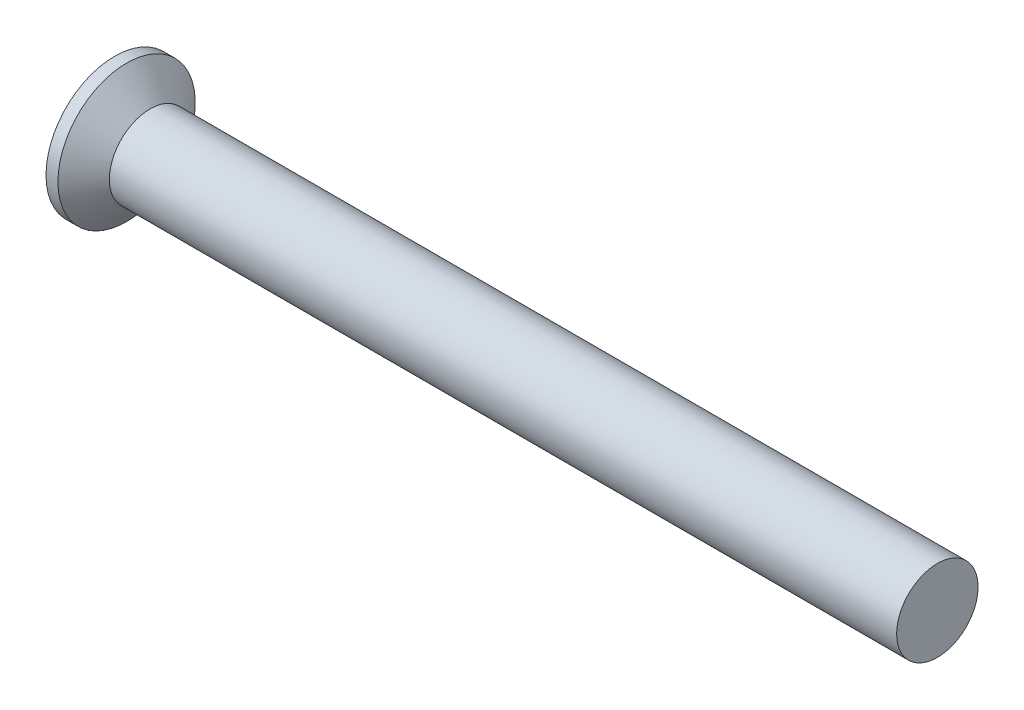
ISO-10303-21;
HEADER;
FILE_DESCRIPTION(('STEP AP214'),'2;1');
FILE_NAME('part.step','',(''),(''),'','','');
FILE_SCHEMA(('AUTOMOTIVE_DESIGN { 1 0 10303 214 1 1 1 1 }'));
ENDSEC;
DATA;
#1=APPLICATION_CONTEXT('core data for automotive mechanical design processes');
#2=APPLICATION_PROTOCOL_DEFINITION('international standard','automotive_design',2000,#1);
#3=PRODUCT_CONTEXT('',#1,'mechanical');
#4=PRODUCT('Part','Part','',(#3));
#5=PRODUCT_RELATED_PRODUCT_CATEGORY('part','',(#4));
#6=PRODUCT_DEFINITION_FORMATION('','',#4);
#7=PRODUCT_DEFINITION_CONTEXT('part definition',#1,'design');
#8=PRODUCT_DEFINITION('design','',#6,#7);
#9=PRODUCT_DEFINITION_SHAPE('','',#8);
#10=(LENGTH_UNIT() NAMED_UNIT(*) SI_UNIT(.MILLI.,.METRE.));
#11=(NAMED_UNIT(*) PLANE_ANGLE_UNIT() SI_UNIT($,.RADIAN.));
#12=(NAMED_UNIT(*) SI_UNIT($,.STERADIAN.) SOLID_ANGLE_UNIT());
#13=UNCERTAINTY_MEASURE_WITH_UNIT(LENGTH_MEASURE(1.E-05),#10,'distance_accuracy_value','');
#14=(GEOMETRIC_REPRESENTATION_CONTEXT(3) GLOBAL_UNCERTAINTY_ASSIGNED_CONTEXT((#13)) GLOBAL_UNIT_ASSIGNED_CONTEXT((#10,
#11,#12)) REPRESENTATION_CONTEXT('',''));
#15=CARTESIAN_POINT('',(0.,0.,0.));
#16=DIRECTION('',(0.,0.,1.));
#17=DIRECTION('',(1.,0.,0.));
#18=AXIS2_PLACEMENT_3D('',#15,#16,#17);
#19=CARTESIAN_POINT('',(0.,0.,0.));
#20=DIRECTION('',(-1.,0.,0.));
#21=DIRECTION('',(0.,0.,1.));
#22=AXIS2_PLACEMENT_3D('',#19,#20,#21);
#23=PLANE('',#22);
#24=CARTESIAN_POINT('',(0.,0.,0.));
#25=DIRECTION('',(-1.,0.,0.));
#26=DIRECTION('',(0.,0.,1.));
#27=AXIS2_PLACEMENT_3D('',#24,#25,#26);
#28=CIRCLE('',#27,2.1209);
#29=CARTESIAN_POINT('',(0.,0.,2.1209));
#30=VERTEX_POINT('',#29);
#31=EDGE_CURVE('E37',#30,#30,#28,.T.);
#32=ORIENTED_EDGE('',*,*,#31,.T.);
#33=EDGE_LOOP('',(#32));
#34=FACE_BOUND('',#33,.T.);
#35=DIRECTION('',(0.,1.,0.));
#36=VECTOR('',#35,1.);
#37=CARTESIAN_POINT('',(0.,-1.4986,-0.342899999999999));
#38=LINE('',#37,#36);
#39=CARTESIAN_POINT('',(0.,-1.4986,-0.342899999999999));
#40=VERTEX_POINT('',#39);
#41=CARTESIAN_POINT('',(0.,-0.342899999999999,-0.342899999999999));
#42=VERTEX_POINT('',#41);
#43=EDGE_CURVE('E98',#40,#42,#38,.T.);
#44=ORIENTED_EDGE('',*,*,#43,.T.);
#45=DIRECTION('',(0.,0.,-1.));
#46=VECTOR('',#45,1.);
#47=CARTESIAN_POINT('',(0.,-0.342900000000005,1.4986));
#48=LINE('',#47,#46);
#49=CARTESIAN_POINT('',(0.,-0.342899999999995,-1.4986));
#50=VERTEX_POINT('',#49);
#51=EDGE_CURVE('E78',#42,#50,#48,.T.);
#52=ORIENTED_EDGE('',*,*,#51,.T.);
#53=DIRECTION('',(0.,1.,0.));
#54=VECTOR('',#53,1.);
#55=CARTESIAN_POINT('',(0.,-0.342899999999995,-1.4986));
#56=LINE('',#55,#54);
#57=CARTESIAN_POINT('',(0.,0.342900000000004,-1.4986));
#58=VERTEX_POINT('',#57);
#59=EDGE_CURVE('E333',#50,#58,#56,.T.);
#60=ORIENTED_EDGE('',*,*,#59,.T.);
#61=DIRECTION('',(0.,0.,1.));
#62=VECTOR('',#61,1.);
#63=CARTESIAN_POINT('',(0.,0.342900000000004,-1.4986));
#64=LINE('',#63,#62);
#65=CARTESIAN_POINT('',(0.,0.3429,-0.342899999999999));
#66=VERTEX_POINT('',#65);
#67=EDGE_CURVE('E94',#58,#66,#64,.T.);
#68=ORIENTED_EDGE('',*,*,#67,.T.);
#69=CARTESIAN_POINT('',(0.,1.4986,-0.342899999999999));
#70=VERTEX_POINT('',#69);
#71=EDGE_CURVE('E88',#66,#70,#38,.T.);
#72=ORIENTED_EDGE('',*,*,#71,.T.);
#73=DIRECTION('',(0.,0.,1.));
#74=VECTOR('',#73,1.);
#75=CARTESIAN_POINT('',(0.,1.4986,-0.342899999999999));
#76=LINE('',#75,#74);
#77=CARTESIAN_POINT('',(0.,1.4986,0.3429));
#78=VERTEX_POINT('',#77);
#79=EDGE_CURVE('E91',#70,#78,#76,.T.);
#80=ORIENTED_EDGE('',*,*,#79,.T.);
#81=DIRECTION('',(0.,-1.,0.));
#82=VECTOR('',#81,1.);
#83=CARTESIAN_POINT('',(0.,1.4986,0.3429));
#84=LINE('',#83,#82);
#85=CARTESIAN_POINT('',(0.,0.342899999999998,0.3429));
#86=VERTEX_POINT('',#85);
#87=EDGE_CURVE('E345',#78,#86,#84,.T.);
#88=ORIENTED_EDGE('',*,*,#87,.T.);
#89=CARTESIAN_POINT('',(0.,0.342899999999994,1.4986));
#90=VERTEX_POINT('',#89);
#91=EDGE_CURVE('E328',#86,#90,#64,.T.);
#92=ORIENTED_EDGE('',*,*,#91,.T.);
#93=DIRECTION('',(0.,-1.,0.));
#94=VECTOR('',#93,1.);
#95=CARTESIAN_POINT('',(0.,0.342899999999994,1.4986));
#96=LINE('',#95,#94);
#97=CARTESIAN_POINT('',(0.,-0.342900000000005,1.4986));
#98=VERTEX_POINT('',#97);
#99=EDGE_CURVE('E314',#90,#98,#96,.T.);
#100=ORIENTED_EDGE('',*,*,#99,.T.);
#101=CARTESIAN_POINT('',(0.,-0.342900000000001,0.3429));
#102=VERTEX_POINT('',#101);
#103=EDGE_CURVE('E326',#98,#102,#48,.T.);
#104=ORIENTED_EDGE('',*,*,#103,.T.);
#105=CARTESIAN_POINT('',(0.,-1.4986,0.3429));
#106=VERTEX_POINT('',#105);
#107=EDGE_CURVE('E104',#102,#106,#84,.T.);
#108=ORIENTED_EDGE('',*,*,#107,.T.);
#109=DIRECTION('',(0.,0.,-1.));
#110=VECTOR('',#109,1.);
#111=CARTESIAN_POINT('',(0.,-1.4986,0.3429));
#112=LINE('',#111,#110);
#113=EDGE_CURVE('E127',#106,#40,#112,.T.);
#114=ORIENTED_EDGE('',*,*,#113,.T.);
#115=EDGE_LOOP('',(#44,#52,#60,#68,#72,#80,#88,#92,#100,#104,#108,#114));
#116=FACE_BOUND('',#115,.T.);
#117=ADVANCED_FACE('F30',(#34,#116),#23,.T.);
#118=CARTESIAN_POINT('',(2.20846315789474,0.,0.149300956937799));
#119=DIRECTION('',(-0.0873274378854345,0.,-0.996179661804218));
#120=DIRECTION('',(-0.996179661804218,0.,0.0873274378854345));
#121=AXIS2_PLACEMENT_3D('',#118,#119,#120);
#122=PLANE('',#121);
#123=ORIENTED_EDGE('',*,*,#107,.F.);
#124=DIRECTION('',(0.992402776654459,0.0869963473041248,-0.0869963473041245));
#125=VECTOR('',#124,1.);
#126=CARTESIAN_POINT('',(2.22135311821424,-0.148170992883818,0.148170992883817));
#127=LINE('',#126,#125);
#128=CARTESIAN_POINT('',(1.9558,-0.171450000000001,0.171449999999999));
#129=VERTEX_POINT('',#128);
#130=EDGE_CURVE('E122',#102,#129,#127,.T.);
#131=ORIENTED_EDGE('',*,*,#130,.T.);
#132=DIRECTION('',(0.82530731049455,0.560029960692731,-0.0723483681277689));
#133=VECTOR('',#132,1.);
#134=CARTESIAN_POINT('',(0.,-1.4986,0.3429));
#135=LINE('',#134,#133);
#136=EDGE_CURVE('E99',#106,#129,#135,.T.);
#137=ORIENTED_EDGE('',*,*,#136,.F.);
#138=EDGE_LOOP('',(#123,#131,#137));
#139=FACE_BOUND('',#138,.T.);
#140=ADVANCED_FACE('F150',(#139),#122,.T.);
#141=DIRECTION('',(0.82530731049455,-0.56002996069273,-0.0723483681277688));
#142=VECTOR('',#141,1.);
#143=CARTESIAN_POINT('',(0.,1.4986,0.3429));
#144=LINE('',#143,#142);
#145=CARTESIAN_POINT('',(1.9558,0.17145,0.17145));
#146=VERTEX_POINT('',#145);
#147=EDGE_CURVE('E44',#78,#146,#144,.T.);
#148=ORIENTED_EDGE('',*,*,#147,.T.);
#149=DIRECTION('',(-0.992402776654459,0.0869963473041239,0.0869963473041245));
#150=VECTOR('',#149,1.);
#151=CARTESIAN_POINT('',(2.22135311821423,0.148170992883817,0.148170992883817));
#152=LINE('',#151,#150);
#153=EDGE_CURVE('E341',#146,#86,#152,.T.);
#154=ORIENTED_EDGE('',*,*,#153,.T.);
#155=ORIENTED_EDGE('',*,*,#87,.F.);
#156=EDGE_LOOP('',(#148,#154,#155));
#157=FACE_BOUND('',#156,.T.);
#158=ADVANCED_FACE('F154',(#157),#122,.T.);
#159=CARTESIAN_POINT('',(2.20846315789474,0.,-0.149300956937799));
#160=DIRECTION('',(-0.0873274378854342,0.,0.996179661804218));
#161=DIRECTION('',(0.996179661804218,0.,0.0873274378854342));
#162=AXIS2_PLACEMENT_3D('',#159,#160,#161);
#163=PLANE('',#162);
#164=DIRECTION('',(0.82530731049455,0.56002996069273,0.0723483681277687));
#165=VECTOR('',#164,1.);
#166=CARTESIAN_POINT('',(0.,-1.4986,-0.342899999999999));
#167=LINE('',#166,#165);
#168=CARTESIAN_POINT('',(1.9558,-0.17145,-0.171450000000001));
#169=VERTEX_POINT('',#168);
#170=EDGE_CURVE('E53',#40,#169,#167,.T.);
#171=ORIENTED_EDGE('',*,*,#170,.T.);
#172=DIRECTION('',(-0.992402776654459,-0.0869963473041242,-0.0869963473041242));
#173=VECTOR('',#172,1.);
#174=CARTESIAN_POINT('',(2.22135311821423,-0.148170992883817,-0.148170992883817));
#175=LINE('',#174,#173);
#176=EDGE_CURVE('E11',#169,#42,#175,.T.);
#177=ORIENTED_EDGE('',*,*,#176,.T.);
#178=ORIENTED_EDGE('',*,*,#43,.F.);
#179=EDGE_LOOP('',(#171,#177,#178));
#180=FACE_BOUND('',#179,.T.);
#181=ADVANCED_FACE('F147',(#180),#163,.T.);
#182=ORIENTED_EDGE('',*,*,#71,.F.);
#183=DIRECTION('',(0.992402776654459,-0.0869963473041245,0.0869963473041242));
#184=VECTOR('',#183,1.);
#185=CARTESIAN_POINT('',(2.22135311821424,0.148170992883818,-0.148170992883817));
#186=LINE('',#185,#184);
#187=CARTESIAN_POINT('',(1.9558,0.17145,-0.17145));
#188=VERTEX_POINT('',#187);
#189=EDGE_CURVE('E107',#66,#188,#186,.T.);
#190=ORIENTED_EDGE('',*,*,#189,.T.);
#191=DIRECTION('',(0.82530731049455,-0.560029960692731,0.0723483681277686));
#192=VECTOR('',#191,1.);
#193=CARTESIAN_POINT('',(0.,1.4986,-0.342899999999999));
#194=LINE('',#193,#192);
#195=EDGE_CURVE('E103',#70,#188,#194,.T.);
#196=ORIENTED_EDGE('',*,*,#195,.F.);
#197=EDGE_LOOP('',(#182,#190,#196));
#198=FACE_BOUND('',#197,.T.);
#199=ADVANCED_FACE('F106',(#198),#163,.T.);
#200=CARTESIAN_POINT('',(-6.34999999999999,0.,0.));
#201=DIRECTION('',(-1.,0.,0.));
#202=DIRECTION('',(0.,0.,1.));
#203=AXIS2_PLACEMENT_3D('',#200,#201,#202);
#204=CYLINDRICAL_SURFACE('',#203,2.1209);
#205=CARTESIAN_POINT('',(0.367553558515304,0.,0.));
#206=DIRECTION('',(-1.,0.,0.));
#207=DIRECTION('',(0.,0.,1.));
#208=AXIS2_PLACEMENT_3D('',#205,#206,#207);
#209=CIRCLE('',#208,2.1209);
#210=CARTESIAN_POINT('',(0.367553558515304,0.,2.1209));
#211=VERTEX_POINT('',#210);
#212=EDGE_CURVE('E130',#211,#211,#209,.T.);
#213=ORIENTED_EDGE('',*,*,#212,.T.);
#214=EDGE_LOOP('',(#213));
#215=FACE_BOUND('',#214,.T.);
#216=ORIENTED_EDGE('',*,*,#31,.F.);
#217=EDGE_LOOP('',(#216));
#218=FACE_BOUND('',#217,.T.);
#219=ADVANCED_FACE('F136',(#215,#218),#204,.T.);
#220=CARTESIAN_POINT('',(0.367553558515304,0.,0.));
#221=DIRECTION('',(-1.,0.,0.));
#222=DIRECTION('',(0.,0.,1.));
#223=AXIS2_PLACEMENT_3D('',#220,#221,#222);
#224=CONICAL_SURFACE('',#223,2.1209,0.872664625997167);
#225=CARTESIAN_POINT('',(1.0922,0.,0.));
#226=DIRECTION('',(-1.,0.,0.));
#227=DIRECTION('',(0.,0.,1.));
#228=AXIS2_PLACEMENT_3D('',#225,#226,#227);
#229=CIRCLE('',#228,1.2573);
#230=CARTESIAN_POINT('',(1.0922,0.,1.2573));
#231=VERTEX_POINT('',#230);
#232=EDGE_CURVE('E126',#231,#231,#229,.T.);
#233=ORIENTED_EDGE('',*,*,#232,.T.);
#234=EDGE_LOOP('',(#233));
#235=FACE_BOUND('',#234,.T.);
#236=ORIENTED_EDGE('',*,*,#212,.F.);
#237=EDGE_LOOP('',(#236));
#238=FACE_BOUND('',#237,.T.);
#239=ADVANCED_FACE('F138',(#235,#238),#224,.T.);
#240=CARTESIAN_POINT('',(-6.34999999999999,0.,0.));
#241=DIRECTION('',(-1.,0.,0.));
#242=DIRECTION('',(0.,0.,1.));
#243=AXIS2_PLACEMENT_3D('',#240,#241,#242);
#244=CYLINDRICAL_SURFACE('',#243,1.2573);
#245=CARTESIAN_POINT('',(25.4,0.,0.));
#246=DIRECTION('',(-1.,0.,0.));
#247=DIRECTION('',(0.,0.,1.));
#248=AXIS2_PLACEMENT_3D('',#245,#246,#247);
#249=CIRCLE('',#248,1.2573);
#250=CARTESIAN_POINT('',(25.4,0.,1.2573));
#251=VERTEX_POINT('',#250);
#252=EDGE_CURVE('E123',#251,#251,#249,.T.);
#253=ORIENTED_EDGE('',*,*,#252,.T.);
#254=EDGE_LOOP('',(#253));
#255=FACE_BOUND('',#254,.T.);
#256=ORIENTED_EDGE('',*,*,#232,.F.);
#257=EDGE_LOOP('',(#256));
#258=FACE_BOUND('',#257,.T.);
#259=ADVANCED_FACE('F144',(#255,#258),#244,.T.);
#260=CARTESIAN_POINT('',(25.4,1.2573,0.));
#261=DIRECTION('',(1.,0.,0.));
#262=DIRECTION('',(0.,0.,-1.));
#263=AXIS2_PLACEMENT_3D('',#260,#261,#262);
#264=PLANE('',#263);
#265=ORIENTED_EDGE('',*,*,#252,.F.);
#266=EDGE_LOOP('',(#265));
#267=FACE_BOUND('',#266,.T.);
#268=ADVANCED_FACE('F174',(#267),#264,.T.);
#269=CARTESIAN_POINT('',(1.9558,0.17145,-0.17145));
#270=DIRECTION('',(1.,0.,0.));
#271=DIRECTION('',(0.,0.,-1.));
#272=AXIS2_PLACEMENT_3D('',#269,#270,#271);
#273=PLANE('',#272);
#274=DIRECTION('',(0.,1.,0.));
#275=VECTOR('',#274,1.);
#276=CARTESIAN_POINT('',(1.9558,-0.17145,-0.17145));
#277=LINE('',#276,#275);
#278=EDGE_CURVE('E118',#169,#188,#277,.T.);
#279=ORIENTED_EDGE('',*,*,#278,.F.);
#280=DIRECTION('',(0.,0.,-1.));
#281=VECTOR('',#280,1.);
#282=CARTESIAN_POINT('',(1.9558,-0.17145,0.17145));
#283=LINE('',#282,#281);
#284=EDGE_CURVE('E109',#129,#169,#283,.T.);
#285=ORIENTED_EDGE('',*,*,#284,.F.);
#286=DIRECTION('',(0.,-1.,0.));
#287=VECTOR('',#286,1.);
#288=CARTESIAN_POINT('',(1.9558,0.17145,0.17145));
#289=LINE('',#288,#287);
#290=EDGE_CURVE('E112',#146,#129,#289,.T.);
#291=ORIENTED_EDGE('',*,*,#290,.F.);
#292=DIRECTION('',(0.,0.,1.));
#293=VECTOR('',#292,1.);
#294=CARTESIAN_POINT('',(1.9558,0.17145,-0.17145));
#295=LINE('',#294,#293);
#296=EDGE_CURVE('E116',#188,#146,#295,.T.);
#297=ORIENTED_EDGE('',*,*,#296,.F.);
#298=EDGE_LOOP('',(#279,#285,#291,#297));
#299=FACE_BOUND('',#298,.T.);
#300=ADVANCED_FACE('F171',(#299),#273,.F.);
#301=CARTESIAN_POINT('',(0.,-1.4986,-0.342899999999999));
#302=DIRECTION('',(-0.561501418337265,0.827475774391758,0.));
#303=DIRECTION('',(-0.827475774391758,-0.561501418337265,0.));
#304=AXIS2_PLACEMENT_3D('',#301,#302,#303);
#305=PLANE('',#304);
#306=ORIENTED_EDGE('',*,*,#170,.F.);
#307=ORIENTED_EDGE('',*,*,#113,.F.);
#308=ORIENTED_EDGE('',*,*,#136,.T.);
#309=ORIENTED_EDGE('',*,*,#284,.T.);
#310=EDGE_LOOP('',(#306,#307,#308,#309));
#311=FACE_BOUND('',#310,.T.);
#312=ADVANCED_FACE('F163',(#311),#305,.T.);
#313=CARTESIAN_POINT('',(0.,1.4986,0.3429));
#314=DIRECTION('',(-0.561501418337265,-0.827475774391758,0.));
#315=DIRECTION('',(0.827475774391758,-0.561501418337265,0.));
#316=AXIS2_PLACEMENT_3D('',#313,#314,#315);
#317=PLANE('',#316);
#318=ORIENTED_EDGE('',*,*,#147,.F.);
#319=ORIENTED_EDGE('',*,*,#79,.F.);
#320=ORIENTED_EDGE('',*,*,#195,.T.);
#321=ORIENTED_EDGE('',*,*,#296,.T.);
#322=EDGE_LOOP('',(#318,#319,#320,#321));
#323=FACE_BOUND('',#322,.T.);
#324=ADVANCED_FACE('F102',(#323),#317,.T.);
#325=CARTESIAN_POINT('',(2.20846315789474,-0.149300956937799,0.));
#326=DIRECTION('',(-0.0873274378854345,0.996179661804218,0.));
#327=DIRECTION('',(-0.996179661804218,-0.0873274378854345,0.));
#328=AXIS2_PLACEMENT_3D('',#325,#326,#327);
#329=PLANE('',#328);
#330=DIRECTION('',(0.82530731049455,0.072348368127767,0.560029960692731));
#331=VECTOR('',#330,1.);
#332=CARTESIAN_POINT('',(0.,-0.342899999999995,-1.4986));
#333=LINE('',#332,#331);
#334=EDGE_CURVE('E335',#50,#169,#333,.T.);
#335=ORIENTED_EDGE('',*,*,#334,.F.);
#336=ORIENTED_EDGE('',*,*,#51,.F.);
#337=ORIENTED_EDGE('',*,*,#176,.F.);
#338=EDGE_LOOP('',(#335,#336,#337));
#339=FACE_BOUND('',#338,.T.);
#340=ADVANCED_FACE('F170',(#339),#329,.T.);
#341=CARTESIAN_POINT('',(2.20846315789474,0.149300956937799,0.));
#342=DIRECTION('',(-0.0873274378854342,-0.996179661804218,0.));
#343=DIRECTION('',(0.996179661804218,-0.0873274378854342,0.));
#344=AXIS2_PLACEMENT_3D('',#341,#342,#343);
#345=PLANE('',#344);
#346=ORIENTED_EDGE('',*,*,#67,.F.);
#347=DIRECTION('',(0.82530731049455,-0.0723483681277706,0.56002996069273));
#348=VECTOR('',#347,1.);
#349=CARTESIAN_POINT('',(0.,0.342900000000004,-1.4986));
#350=LINE('',#349,#348);
#351=EDGE_CURVE('E69',#58,#188,#350,.T.);
#352=ORIENTED_EDGE('',*,*,#351,.T.);
#353=ORIENTED_EDGE('',*,*,#189,.F.);
#354=EDGE_LOOP('',(#346,#352,#353));
#355=FACE_BOUND('',#354,.T.);
#356=ADVANCED_FACE('F214',(#355),#345,.T.);
#357=CARTESIAN_POINT('',(0.,0.342900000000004,-1.4986));
#358=DIRECTION('',(-0.561501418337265,0.,0.827475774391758));
#359=DIRECTION('',(-0.827475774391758,0.,-0.561501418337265));
#360=AXIS2_PLACEMENT_3D('',#357,#358,#359);
#361=PLANE('',#360);
#362=ORIENTED_EDGE('',*,*,#351,.F.);
#363=ORIENTED_EDGE('',*,*,#59,.F.);
#364=ORIENTED_EDGE('',*,*,#334,.T.);
#365=ORIENTED_EDGE('',*,*,#278,.T.);
#366=EDGE_LOOP('',(#362,#363,#364,#365));
#367=FACE_BOUND('',#366,.T.);
#368=ADVANCED_FACE('F222',(#367),#361,.T.);
#369=ORIENTED_EDGE('',*,*,#103,.F.);
#370=DIRECTION('',(0.82530731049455,0.0723483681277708,-0.56002996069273));
#371=VECTOR('',#370,1.);
#372=CARTESIAN_POINT('',(0.,-0.342900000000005,1.4986));
#373=LINE('',#372,#371);
#374=EDGE_CURVE('E311',#98,#129,#373,.T.);
#375=ORIENTED_EDGE('',*,*,#374,.T.);
#376=ORIENTED_EDGE('',*,*,#130,.F.);
#377=EDGE_LOOP('',(#369,#375,#376));
#378=FACE_BOUND('',#377,.T.);
#379=ADVANCED_FACE('F216',(#378),#329,.T.);
#380=DIRECTION('',(0.82530731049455,-0.0723483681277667,-0.560029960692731));
#381=VECTOR('',#380,1.);
#382=CARTESIAN_POINT('',(0.,0.342899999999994,1.4986));
#383=LINE('',#382,#381);
#384=EDGE_CURVE('E322',#90,#146,#383,.T.);
#385=ORIENTED_EDGE('',*,*,#384,.F.);
#386=ORIENTED_EDGE('',*,*,#91,.F.);
#387=ORIENTED_EDGE('',*,*,#153,.F.);
#388=EDGE_LOOP('',(#385,#386,#387));
#389=FACE_BOUND('',#388,.T.);
#390=ADVANCED_FACE('F224',(#389),#345,.T.);
#391=CARTESIAN_POINT('',(0.,-0.342900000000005,1.4986));
#392=DIRECTION('',(-0.561501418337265,0.,-0.827475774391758));
#393=DIRECTION('',(0.827475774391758,0.,-0.561501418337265));
#394=AXIS2_PLACEMENT_3D('',#391,#392,#393);
#395=PLANE('',#394);
#396=ORIENTED_EDGE('',*,*,#374,.F.);
#397=ORIENTED_EDGE('',*,*,#99,.F.);
#398=ORIENTED_EDGE('',*,*,#384,.T.);
#399=ORIENTED_EDGE('',*,*,#290,.T.);
#400=EDGE_LOOP('',(#396,#397,#398,#399));
#401=FACE_BOUND('',#400,.T.);
#402=ADVANCED_FACE('F243',(#401),#395,.T.);
#403=CLOSED_SHELL('',(#117,#140,#158,#181,#199,#219,#239,#259,#268,#300,#312,#324,#340,#356,
#368,#379,#390,#402));
#404=MANIFOLD_SOLID_BREP('B2',#403);
#405=ADVANCED_BREP_SHAPE_REPRESENTATION('',(#18,#404),#14);
#406=SHAPE_DEFINITION_REPRESENTATION(#9,#405);
ENDSEC;
END-ISO-10303-21;
